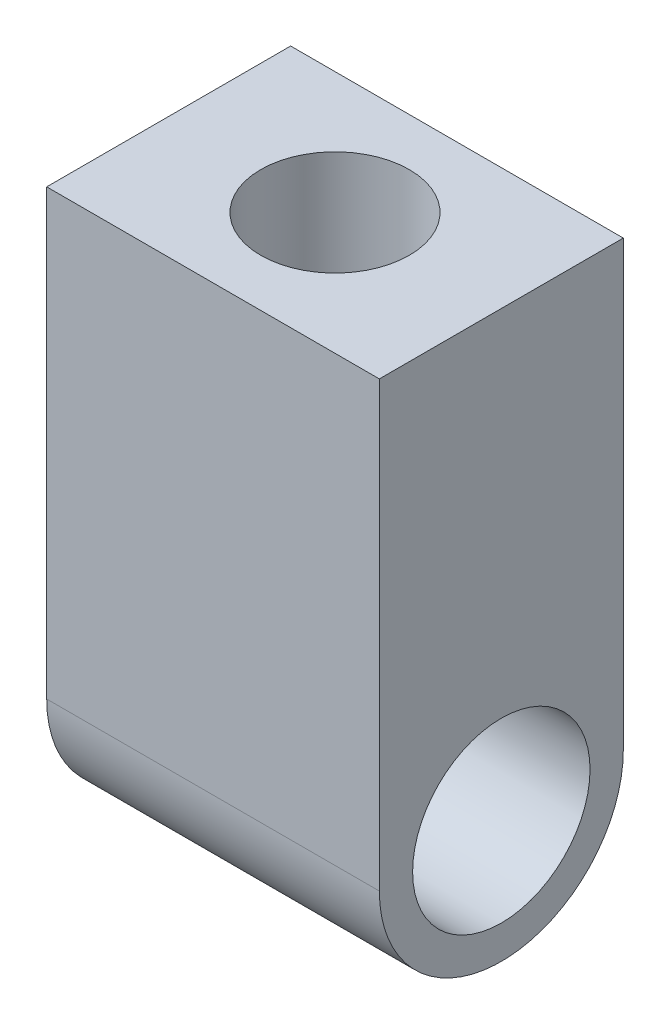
ISO-10303-21;
HEADER;
FILE_DESCRIPTION(('STEP AP214'),'2;1');
FILE_NAME('part.step','',(''),(''),'','','');
FILE_SCHEMA(('AUTOMOTIVE_DESIGN { 1 0 10303 214 1 1 1 1 }'));
ENDSEC;
DATA;
#1=APPLICATION_CONTEXT('core data for automotive mechanical design processes');
#2=APPLICATION_PROTOCOL_DEFINITION('international standard','automotive_design',2000,#1);
#3=PRODUCT_CONTEXT('',#1,'mechanical');
#4=PRODUCT('Part','Part','',(#3));
#5=PRODUCT_RELATED_PRODUCT_CATEGORY('part','',(#4));
#6=PRODUCT_DEFINITION_FORMATION('','',#4);
#7=PRODUCT_DEFINITION_CONTEXT('part definition',#1,'design');
#8=PRODUCT_DEFINITION('design','',#6,#7);
#9=PRODUCT_DEFINITION_SHAPE('','',#8);
#10=(LENGTH_UNIT() NAMED_UNIT(*) SI_UNIT(.MILLI.,.METRE.));
#11=(NAMED_UNIT(*) PLANE_ANGLE_UNIT() SI_UNIT($,.RADIAN.));
#12=(NAMED_UNIT(*) SI_UNIT($,.STERADIAN.) SOLID_ANGLE_UNIT());
#13=UNCERTAINTY_MEASURE_WITH_UNIT(LENGTH_MEASURE(1.E-05),#10,'distance_accuracy_value','');
#14=(GEOMETRIC_REPRESENTATION_CONTEXT(3) GLOBAL_UNCERTAINTY_ASSIGNED_CONTEXT((#13)) GLOBAL_UNIT_ASSIGNED_CONTEXT((#10,
#11,#12)) REPRESENTATION_CONTEXT('',''));
#15=CARTESIAN_POINT('',(0.,0.,0.));
#16=DIRECTION('',(0.,0.,1.));
#17=DIRECTION('',(1.,0.,0.));
#18=AXIS2_PLACEMENT_3D('',#15,#16,#17);
#19=CARTESIAN_POINT('',(7.5,0.,0.));
#20=DIRECTION('',(1.,0.,0.));
#21=DIRECTION('',(0.,0.,-1.));
#22=AXIS2_PLACEMENT_3D('',#19,#20,#21);
#23=PLANE('',#22);
#24=CARTESIAN_POINT('',(7.5,0.,0.));
#25=DIRECTION('',(1.,0.,0.));
#26=DIRECTION('',(0.,0.,-1.));
#27=AXIS2_PLACEMENT_3D('',#24,#25,#26);
#28=CIRCLE('',#27,5.5);
#29=CARTESIAN_POINT('',(7.5,0.,5.5));
#30=VERTEX_POINT('',#29);
#31=CARTESIAN_POINT('',(7.5,0.,-5.5));
#32=VERTEX_POINT('',#31);
#33=EDGE_CURVE('E85',#30,#32,#28,.T.);
#34=ORIENTED_EDGE('',*,*,#33,.T.);
#35=DIRECTION('',(0.,1.,0.));
#36=VECTOR('',#35,1.);
#37=CARTESIAN_POINT('',(7.5,20.,-5.5));
#38=LINE('',#37,#36);
#39=CARTESIAN_POINT('',(7.5,20.,-5.5));
#40=VERTEX_POINT('',#39);
#41=EDGE_CURVE('E80',#32,#40,#38,.T.);
#42=ORIENTED_EDGE('',*,*,#41,.T.);
#43=DIRECTION('',(0.,0.,1.));
#44=VECTOR('',#43,1.);
#45=CARTESIAN_POINT('',(7.5,20.,5.5));
#46=LINE('',#45,#44);
#47=CARTESIAN_POINT('',(7.5,20.,5.5));
#48=VERTEX_POINT('',#47);
#49=EDGE_CURVE('E83',#40,#48,#46,.T.);
#50=ORIENTED_EDGE('',*,*,#49,.T.);
#51=DIRECTION('',(0.,-1.,0.));
#52=VECTOR('',#51,1.);
#53=CARTESIAN_POINT('',(7.5,0.,5.5));
#54=LINE('',#53,#52);
#55=EDGE_CURVE('E50',#48,#30,#54,.T.);
#56=ORIENTED_EDGE('',*,*,#55,.T.);
#57=EDGE_LOOP('',(#34,#42,#50,#56));
#58=FACE_BOUND('',#57,.T.);
#59=CARTESIAN_POINT('',(7.5,0.,0.));
#60=DIRECTION('',(1.,0.,0.));
#61=DIRECTION('',(0.,0.,-1.));
#62=AXIS2_PLACEMENT_3D('',#59,#60,#61);
#63=CIRCLE('',#62,4.);
#64=CARTESIAN_POINT('',(7.5,0.,-4.));
#65=VERTEX_POINT('',#64);
#66=EDGE_CURVE('E100',#65,#65,#63,.T.);
#67=ORIENTED_EDGE('',*,*,#66,.F.);
#68=EDGE_LOOP('',(#67));
#69=FACE_BOUND('',#68,.T.);
#70=ADVANCED_FACE('F33',(#58,#69),#23,.T.);
#71=CARTESIAN_POINT('',(-7.5,0.,0.));
#72=DIRECTION('',(1.,0.,0.));
#73=DIRECTION('',(0.,0.,-1.));
#74=AXIS2_PLACEMENT_3D('',#71,#72,#73);
#75=PLANE('',#74);
#76=CARTESIAN_POINT('',(-7.5,0.,0.));
#77=DIRECTION('',(1.,0.,0.));
#78=DIRECTION('',(0.,0.,-1.));
#79=AXIS2_PLACEMENT_3D('',#76,#77,#78);
#80=CIRCLE('',#79,5.5);
#81=CARTESIAN_POINT('',(-7.5,0.,5.5));
#82=VERTEX_POINT('',#81);
#83=CARTESIAN_POINT('',(-7.5,0.,-5.5));
#84=VERTEX_POINT('',#83);
#85=EDGE_CURVE('E97',#82,#84,#80,.T.);
#86=ORIENTED_EDGE('',*,*,#85,.F.);
#87=DIRECTION('',(0.,-1.,0.));
#88=VECTOR('',#87,1.);
#89=CARTESIAN_POINT('',(-7.5,0.,5.5));
#90=LINE('',#89,#88);
#91=CARTESIAN_POINT('',(-7.5,20.,5.5));
#92=VERTEX_POINT('',#91);
#93=EDGE_CURVE('E73',#92,#82,#90,.T.);
#94=ORIENTED_EDGE('',*,*,#93,.F.);
#95=DIRECTION('',(0.,0.,1.));
#96=VECTOR('',#95,1.);
#97=CARTESIAN_POINT('',(-7.5,20.,5.5));
#98=LINE('',#97,#96);
#99=CARTESIAN_POINT('',(-7.5,20.,-5.5));
#100=VERTEX_POINT('',#99);
#101=EDGE_CURVE('E67',#100,#92,#98,.T.);
#102=ORIENTED_EDGE('',*,*,#101,.F.);
#103=DIRECTION('',(0.,1.,0.));
#104=VECTOR('',#103,1.);
#105=CARTESIAN_POINT('',(-7.5,20.,-5.5));
#106=LINE('',#105,#104);
#107=EDGE_CURVE('E89',#84,#100,#106,.T.);
#108=ORIENTED_EDGE('',*,*,#107,.F.);
#109=EDGE_LOOP('',(#86,#94,#102,#108));
#110=FACE_BOUND('',#109,.T.);
#111=CARTESIAN_POINT('',(-7.5,0.,0.));
#112=DIRECTION('',(1.,0.,0.));
#113=DIRECTION('',(0.,0.,-1.));
#114=AXIS2_PLACEMENT_3D('',#111,#112,#113);
#115=CIRCLE('',#114,4.);
#116=CARTESIAN_POINT('',(-7.5,0.,-4.));
#117=VERTEX_POINT('',#116);
#118=EDGE_CURVE('E112',#117,#117,#115,.T.);
#119=ORIENTED_EDGE('',*,*,#118,.T.);
#120=EDGE_LOOP('',(#119));
#121=FACE_BOUND('',#120,.T.);
#122=ADVANCED_FACE('F108',(#110,#121),#75,.F.);
#123=CARTESIAN_POINT('',(7.5,0.,0.));
#124=DIRECTION('',(-1.,0.,0.));
#125=DIRECTION('',(0.,0.,1.));
#126=AXIS2_PLACEMENT_3D('',#123,#124,#125);
#127=CYLINDRICAL_SURFACE('',#126,5.5);
#128=ORIENTED_EDGE('',*,*,#85,.T.);
#129=DIRECTION('',(-1.,0.,0.));
#130=VECTOR('',#129,1.);
#131=CARTESIAN_POINT('',(7.5,0.,-5.5));
#132=LINE('',#131,#130);
#133=EDGE_CURVE('E11',#32,#84,#132,.T.);
#134=ORIENTED_EDGE('',*,*,#133,.F.);
#135=ORIENTED_EDGE('',*,*,#33,.F.);
#136=DIRECTION('',(-1.,0.,0.));
#137=VECTOR('',#136,1.);
#138=CARTESIAN_POINT('',(7.5,0.,5.5));
#139=LINE('',#138,#137);
#140=EDGE_CURVE('E93',#30,#82,#139,.T.);
#141=ORIENTED_EDGE('',*,*,#140,.T.);
#142=EDGE_LOOP('',(#128,#134,#135,#141));
#143=FACE_BOUND('',#142,.T.);
#144=ADVANCED_FACE('F35',(#143),#127,.T.);
#145=CARTESIAN_POINT('',(7.5,20.,-5.5));
#146=DIRECTION('',(0.,0.,1.));
#147=DIRECTION('',(0.,-1.,0.));
#148=AXIS2_PLACEMENT_3D('',#145,#146,#147);
#149=PLANE('',#148);
#150=ORIENTED_EDGE('',*,*,#107,.T.);
#151=DIRECTION('',(-1.,0.,0.));
#152=VECTOR('',#151,1.);
#153=CARTESIAN_POINT('',(7.5,20.,-5.5));
#154=LINE('',#153,#152);
#155=EDGE_CURVE('E42',#40,#100,#154,.T.);
#156=ORIENTED_EDGE('',*,*,#155,.F.);
#157=ORIENTED_EDGE('',*,*,#41,.F.);
#158=ORIENTED_EDGE('',*,*,#133,.T.);
#159=EDGE_LOOP('',(#150,#156,#157,#158));
#160=FACE_BOUND('',#159,.T.);
#161=ADVANCED_FACE('F88',(#160),#149,.F.);
#162=CARTESIAN_POINT('',(7.5,20.,5.5));
#163=DIRECTION('',(0.,-1.,0.));
#164=DIRECTION('',(0.,0.,-1.));
#165=AXIS2_PLACEMENT_3D('',#162,#163,#164);
#166=PLANE('',#165);
#167=CARTESIAN_POINT('',(0.,20.,0.));
#168=DIRECTION('',(0.,1.,0.));
#169=DIRECTION('',(0.,0.,1.));
#170=AXIS2_PLACEMENT_3D('',#167,#168,#169);
#171=CIRCLE('',#170,3.35);
#172=CARTESIAN_POINT('',(0.,20.,3.35));
#173=VERTEX_POINT('',#172);
#174=EDGE_CURVE('E118',#173,#173,#171,.T.);
#175=ORIENTED_EDGE('',*,*,#174,.F.);
#176=EDGE_LOOP('',(#175));
#177=FACE_BOUND('',#176,.T.);
#178=ORIENTED_EDGE('',*,*,#101,.T.);
#179=DIRECTION('',(-1.,0.,0.));
#180=VECTOR('',#179,1.);
#181=CARTESIAN_POINT('',(7.5,20.,5.5));
#182=LINE('',#181,#180);
#183=EDGE_CURVE('E90',#48,#92,#182,.T.);
#184=ORIENTED_EDGE('',*,*,#183,.F.);
#185=ORIENTED_EDGE('',*,*,#49,.F.);
#186=ORIENTED_EDGE('',*,*,#155,.T.);
#187=EDGE_LOOP('',(#178,#184,#185,#186));
#188=FACE_BOUND('',#187,.T.);
#189=ADVANCED_FACE('F91',(#177,#188),#166,.F.);
#190=CARTESIAN_POINT('',(7.5,0.,5.5));
#191=DIRECTION('',(0.,0.,-1.));
#192=DIRECTION('',(0.,1.,0.));
#193=AXIS2_PLACEMENT_3D('',#190,#191,#192);
#194=PLANE('',#193);
#195=ORIENTED_EDGE('',*,*,#93,.T.);
#196=ORIENTED_EDGE('',*,*,#140,.F.);
#197=ORIENTED_EDGE('',*,*,#55,.F.);
#198=ORIENTED_EDGE('',*,*,#183,.T.);
#199=EDGE_LOOP('',(#195,#196,#197,#198));
#200=FACE_BOUND('',#199,.T.);
#201=ADVANCED_FACE('F105',(#200),#194,.F.);
#202=CARTESIAN_POINT('',(7.5,0.,0.));
#203=DIRECTION('',(-1.,0.,0.));
#204=DIRECTION('',(0.,0.,1.));
#205=AXIS2_PLACEMENT_3D('',#202,#203,#204);
#206=CYLINDRICAL_SURFACE('',#205,4.);
#207=ORIENTED_EDGE('',*,*,#66,.T.);
#208=EDGE_LOOP('',(#207));
#209=FACE_BOUND('',#208,.T.);
#210=ORIENTED_EDGE('',*,*,#118,.F.);
#211=EDGE_LOOP('',(#210));
#212=FACE_BOUND('',#211,.T.);
#213=ADVANCED_FACE('F129',(#209,#212),#206,.F.);
#214=CARTESIAN_POINT('',(0.,6.,0.));
#215=DIRECTION('',(0.,1.,0.));
#216=DIRECTION('',(0.,0.,1.));
#217=AXIS2_PLACEMENT_3D('',#214,#215,#216);
#218=CYLINDRICAL_SURFACE('',#217,3.35);
#219=CARTESIAN_POINT('',(0.,6.,0.));
#220=DIRECTION('',(0.,1.,0.));
#221=DIRECTION('',(0.,0.,1.));
#222=AXIS2_PLACEMENT_3D('',#219,#220,#221);
#223=CIRCLE('',#222,3.35);
#224=CARTESIAN_POINT('',(0.,6.,3.35));
#225=VERTEX_POINT('',#224);
#226=EDGE_CURVE('E115',#225,#225,#223,.T.);
#227=ORIENTED_EDGE('',*,*,#226,.F.);
#228=EDGE_LOOP('',(#227));
#229=FACE_BOUND('',#228,.T.);
#230=ORIENTED_EDGE('',*,*,#174,.T.);
#231=EDGE_LOOP('',(#230));
#232=FACE_BOUND('',#231,.T.);
#233=ADVANCED_FACE('F126',(#229,#232),#218,.F.);
#234=CARTESIAN_POINT('',(0.,6.,0.));
#235=DIRECTION('',(0.,1.,0.));
#236=DIRECTION('',(0.,0.,1.));
#237=AXIS2_PLACEMENT_3D('',#234,#235,#236);
#238=PLANE('',#237);
#239=ORIENTED_EDGE('',*,*,#226,.T.);
#240=EDGE_LOOP('',(#239));
#241=FACE_BOUND('',#240,.T.);
#242=ADVANCED_FACE('F124',(#241),#238,.T.);
#243=CLOSED_SHELL('',(#70,#122,#144,#161,#189,#201,#213,#233,#242));
#244=MANIFOLD_SOLID_BREP('B2',#243);
#245=ADVANCED_BREP_SHAPE_REPRESENTATION('',(#18,#244),#14);
#246=SHAPE_DEFINITION_REPRESENTATION(#9,#245);
ENDSEC;
END-ISO-10303-21;
